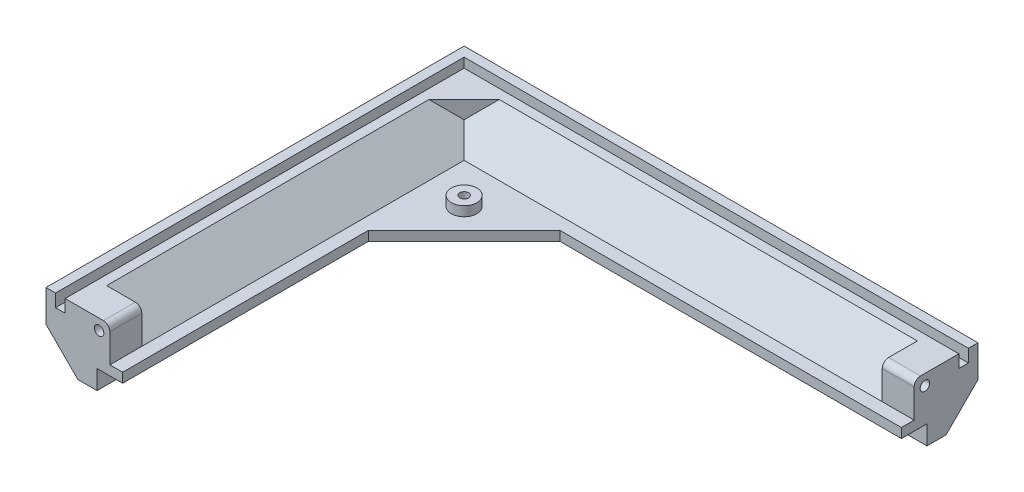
ISO-10303-21;
HEADER;
FILE_DESCRIPTION(('STEP AP214'),'2;1');
FILE_NAME('part.step','',(''),(''),'','','');
FILE_SCHEMA(('AUTOMOTIVE_DESIGN { 1 0 10303 214 1 1 1 1 }'));
ENDSEC;
DATA;
#1=APPLICATION_CONTEXT('core data for automotive mechanical design processes');
#2=APPLICATION_PROTOCOL_DEFINITION('international standard','automotive_design',2000,#1);
#3=PRODUCT_CONTEXT('',#1,'mechanical');
#4=PRODUCT('Part','Part','',(#3));
#5=PRODUCT_RELATED_PRODUCT_CATEGORY('part','',(#4));
#6=PRODUCT_DEFINITION_FORMATION('','',#4);
#7=PRODUCT_DEFINITION_CONTEXT('part definition',#1,'design');
#8=PRODUCT_DEFINITION('design','',#6,#7);
#9=PRODUCT_DEFINITION_SHAPE('','',#8);
#10=(LENGTH_UNIT() NAMED_UNIT(*) SI_UNIT(.MILLI.,.METRE.));
#11=(NAMED_UNIT(*) PLANE_ANGLE_UNIT() SI_UNIT($,.RADIAN.));
#12=(NAMED_UNIT(*) SI_UNIT($,.STERADIAN.) SOLID_ANGLE_UNIT());
#13=UNCERTAINTY_MEASURE_WITH_UNIT(LENGTH_MEASURE(1.E-05),#10,'distance_accuracy_value','');
#14=(GEOMETRIC_REPRESENTATION_CONTEXT(3) GLOBAL_UNCERTAINTY_ASSIGNED_CONTEXT((#13)) GLOBAL_UNIT_ASSIGNED_CONTEXT((#10,
#11,#12)) REPRESENTATION_CONTEXT('',''));
#15=CARTESIAN_POINT('',(0.,0.,0.));
#16=DIRECTION('',(0.,0.,1.));
#17=DIRECTION('',(1.,0.,0.));
#18=AXIS2_PLACEMENT_3D('',#15,#16,#17);
#19=CARTESIAN_POINT('',(-40.0578695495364,-11.,10.5477331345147));
#20=DIRECTION('',(0.,-1.,0.));
#21=DIRECTION('',(0.,0.,-1.));
#22=AXIS2_PLACEMENT_3D('',#19,#20,#21);
#23=PLANE('',#22);
#24=DIRECTION('',(-1.,0.,0.));
#25=VECTOR('',#24,1.);
#26=CARTESIAN_POINT('',(100.942130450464,-11.,6.54773313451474));
#27=LINE('',#26,#25);
#28=CARTESIAN_POINT('',(100.942130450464,-11.,6.54773313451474));
#29=VERTEX_POINT('',#28);
#30=CARTESIAN_POINT('',(90.9421304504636,-11.,6.54773313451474));
#31=VERTEX_POINT('',#30);
#32=EDGE_CURVE('E347',#29,#31,#27,.T.);
#33=ORIENTED_EDGE('',*,*,#32,.T.);
#34=CARTESIAN_POINT('',(-40.0578695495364,-11.,6.54773313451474));
#35=VERTEX_POINT('',#34);
#36=EDGE_CURVE('E228',#31,#35,#27,.T.);
#37=ORIENTED_EDGE('',*,*,#36,.T.);
#38=DIRECTION('',(0.,0.,-1.));
#39=VECTOR('',#38,1.);
#40=CARTESIAN_POINT('',(-40.0578695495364,-11.,117.547733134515));
#41=LINE('',#40,#39);
#42=CARTESIAN_POINT('',(-40.0578695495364,-11.,107.547733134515));
#43=VERTEX_POINT('',#42);
#44=EDGE_CURVE('E219',#43,#35,#41,.T.);
#45=ORIENTED_EDGE('',*,*,#44,.F.);
#46=CARTESIAN_POINT('',(-40.0578695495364,-11.,117.547733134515));
#47=VERTEX_POINT('',#46);
#48=EDGE_CURVE('E225',#47,#43,#41,.T.);
#49=ORIENTED_EDGE('',*,*,#48,.F.);
#50=DIRECTION('',(-1.,0.,0.));
#51=VECTOR('',#50,1.);
#52=CARTESIAN_POINT('',(-36.0578695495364,-11.,117.547733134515));
#53=LINE('',#52,#51);
#54=CARTESIAN_POINT('',(-36.0578695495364,-11.,117.547733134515));
#55=VERTEX_POINT('',#54);
#56=EDGE_CURVE('E279',#55,#47,#53,.T.);
#57=ORIENTED_EDGE('',*,*,#56,.F.);
#58=DIRECTION('',(0.,0.,1.));
#59=VECTOR('',#58,1.);
#60=CARTESIAN_POINT('',(-36.0578695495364,-11.,117.547733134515));
#61=LINE('',#60,#59);
#62=CARTESIAN_POINT('',(-36.0578695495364,-11.,40.5477331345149));
#63=VERTEX_POINT('',#62);
#64=EDGE_CURVE('E271',#63,#55,#61,.T.);
#65=ORIENTED_EDGE('',*,*,#64,.F.);
#66=DIRECTION('',(-0.707106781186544,0.,0.707106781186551));
#67=VECTOR('',#66,1.);
#68=CARTESIAN_POINT('',(-23.0578695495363,-11.,27.5477331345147));
#69=LINE('',#68,#67);
#70=CARTESIAN_POINT('',(-6.05786954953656,-11.,10.5477331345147));
#71=VERTEX_POINT('',#70);
#72=EDGE_CURVE('E410',#63,#71,#69,.F.);
#73=ORIENTED_EDGE('',*,*,#72,.T.);
#74=DIRECTION('',(-1.,0.,0.));
#75=VECTOR('',#74,1.);
#76=CARTESIAN_POINT('',(-40.0578695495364,-11.,10.5477331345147));
#77=LINE('',#76,#75);
#78=CARTESIAN_POINT('',(100.942130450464,-11.,10.5477331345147));
#79=VERTEX_POINT('',#78);
#80=EDGE_CURVE('E285',#79,#71,#77,.T.);
#81=ORIENTED_EDGE('',*,*,#80,.F.);
#82=DIRECTION('',(0.,0.,-1.));
#83=VECTOR('',#82,1.);
#84=CARTESIAN_POINT('',(100.942130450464,-11.,10.5477331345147));
#85=LINE('',#84,#83);
#86=EDGE_CURVE('E288',#79,#29,#85,.T.);
#87=ORIENTED_EDGE('',*,*,#86,.T.);
#88=EDGE_LOOP('',(#33,#37,#45,#49,#57,#65,#73,#81,#87));
#89=FACE_BOUND('',#88,.T.);
#90=CARTESIAN_POINT('',(-27.5578695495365,-11.,19.0477331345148));
#91=DIRECTION('',(0.,-1.,0.));
#92=DIRECTION('',(0.,0.,-1.));
#93=AXIS2_PLACEMENT_3D('',#90,#91,#92);
#94=CIRCLE('',#93,4.);
#95=CARTESIAN_POINT('',(-27.5578695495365,-11.,15.0477331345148));
#96=VERTEX_POINT('',#95);
#97=EDGE_CURVE('E11',#96,#96,#94,.F.);
#98=ORIENTED_EDGE('',*,*,#97,.F.);
#99=EDGE_LOOP('',(#98));
#100=FACE_BOUND('',#99,.T.);
#101=ADVANCED_FACE('F35',(#89,#100),#23,.F.);
#102=CARTESIAN_POINT('',(0.,0.,10.5477331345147));
#103=DIRECTION('',(0.,0.,-1.));
#104=DIRECTION('',(-1.,0.,0.));
#105=AXIS2_PLACEMENT_3D('',#102,#103,#104);
#106=PLANE('',#105);
#107=ORIENTED_EDGE('',*,*,#80,.T.);
#108=DIRECTION('',(0.,-1.,0.));
#109=VECTOR('',#108,1.);
#110=CARTESIAN_POINT('',(-6.05786954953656,-14.,10.5477331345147));
#111=LINE('',#110,#109);
#112=CARTESIAN_POINT('',(-6.05786954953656,-14.,10.5477331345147));
#113=VERTEX_POINT('',#112);
#114=EDGE_CURVE('E408',#71,#113,#111,.T.);
#115=ORIENTED_EDGE('',*,*,#114,.T.);
#116=DIRECTION('',(1.,0.,0.));
#117=VECTOR('',#116,1.);
#118=CARTESIAN_POINT('',(100.942130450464,-14.,10.5477331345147));
#119=LINE('',#118,#117);
#120=CARTESIAN_POINT('',(100.942130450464,-14.,10.5477331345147));
#121=VERTEX_POINT('',#120);
#122=EDGE_CURVE('E281',#113,#121,#119,.T.);
#123=ORIENTED_EDGE('',*,*,#122,.T.);
#124=DIRECTION('',(0.,1.,0.));
#125=VECTOR('',#124,1.);
#126=CARTESIAN_POINT('',(100.942130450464,-11.,10.5477331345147));
#127=LINE('',#126,#125);
#128=EDGE_CURVE('E283',#121,#79,#127,.T.);
#129=ORIENTED_EDGE('',*,*,#128,.T.);
#130=EDGE_LOOP('',(#107,#115,#123,#129));
#131=FACE_BOUND('',#130,.T.);
#132=ADVANCED_FACE('F460',(#131),#106,.F.);
#133=CARTESIAN_POINT('',(-51.0578695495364,-11.,6.54773313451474));
#134=DIRECTION('',(-0.707106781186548,0.,-0.707106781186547));
#135=DIRECTION('',(-0.707106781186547,0.,0.707106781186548));
#136=AXIS2_PLACEMENT_3D('',#133,#134,#135);
#137=PLANE('',#136);
#138=DIRECTION('',(-0.577350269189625,0.577350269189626,0.577350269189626));
#139=VECTOR('',#138,1.);
#140=CARTESIAN_POINT('',(-47.3912028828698,-3.66666666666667,2.88106646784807));
#141=LINE('',#140,#139);
#142=CARTESIAN_POINT('',(-45.5578695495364,-5.49999999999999,1.04773313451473));
#143=VERTEX_POINT('',#142);
#144=CARTESIAN_POINT('',(-51.0578695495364,0.,6.54773313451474));
#145=VERTEX_POINT('',#144);
#146=EDGE_CURVE('E298',#143,#145,#141,.T.);
#147=ORIENTED_EDGE('',*,*,#146,.F.);
#148=DIRECTION('',(-0.577350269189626,-0.577350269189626,0.577350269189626));
#149=VECTOR('',#148,1.);
#150=CARTESIAN_POINT('',(-51.0578695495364,-11.,6.54773313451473));
#151=LINE('',#150,#149);
#152=CARTESIAN_POINT('',(-40.0578695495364,0.,-4.45226686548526));
#153=VERTEX_POINT('',#152);
#154=EDGE_CURVE('E300',#153,#143,#151,.T.);
#155=ORIENTED_EDGE('',*,*,#154,.F.);
#156=DIRECTION('',(-0.707106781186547,0.,0.707106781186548));
#157=VECTOR('',#156,1.);
#158=CARTESIAN_POINT('',(-51.0578695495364,0.,6.54773313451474));
#159=LINE('',#158,#157);
#160=EDGE_CURVE('E303',#153,#145,#159,.T.);
#161=ORIENTED_EDGE('',*,*,#160,.T.);
#162=EDGE_LOOP('',(#147,#155,#161));
#163=FACE_BOUND('',#162,.T.);
#164=ADVANCED_FACE('F465',(#163),#137,.F.);
#165=CARTESIAN_POINT('',(100.942130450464,0.,-4.45226686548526));
#166=DIRECTION('',(0.,-0.707106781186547,-0.707106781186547));
#167=DIRECTION('',(0.,0.707106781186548,-0.707106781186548));
#168=AXIS2_PLACEMENT_3D('',#165,#166,#167);
#169=PLANE('',#168);
#170=ORIENTED_EDGE('',*,*,#36,.F.);
#171=DIRECTION('',(0.,0.707106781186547,-0.707106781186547));
#172=VECTOR('',#171,1.);
#173=CARTESIAN_POINT('',(90.9421304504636,0.,-4.45226686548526));
#174=LINE('',#173,#172);
#175=CARTESIAN_POINT('',(90.9421304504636,0.,-4.45226686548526));
#176=VERTEX_POINT('',#175);
#177=EDGE_CURVE('E261',#31,#176,#174,.T.);
#178=ORIENTED_EDGE('',*,*,#177,.T.);
#179=DIRECTION('',(-1.,0.,0.));
#180=VECTOR('',#179,1.);
#181=CARTESIAN_POINT('',(100.942130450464,0.,-4.45226686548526));
#182=LINE('',#181,#180);
#183=EDGE_CURVE('E349',#176,#153,#182,.T.);
#184=ORIENTED_EDGE('',*,*,#183,.T.);
#185=ORIENTED_EDGE('',*,*,#154,.T.);
#186=DIRECTION('',(-0.577350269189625,0.577350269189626,-0.577350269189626));
#187=VECTOR('',#186,1.);
#188=CARTESIAN_POINT('',(-0.391202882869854,-50.6666666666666,46.2143998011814));
#189=LINE('',#188,#187);
#190=EDGE_CURVE('E296',#35,#143,#189,.T.);
#191=ORIENTED_EDGE('',*,*,#190,.F.);
#192=EDGE_LOOP('',(#170,#178,#184,#185,#191));
#193=FACE_BOUND('',#192,.T.);
#194=ADVANCED_FACE('F472',(#193),#169,.F.);
#195=CARTESIAN_POINT('',(-54.0578695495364,0.,117.547733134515));
#196=DIRECTION('',(0.,-1.,0.));
#197=DIRECTION('',(0.,0.,-1.));
#198=AXIS2_PLACEMENT_3D('',#195,#196,#197);
#199=PLANE('',#198);
#200=DIRECTION('',(0.,0.,-1.));
#201=VECTOR('',#200,1.);
#202=CARTESIAN_POINT('',(-57.0578695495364,0.,117.547733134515));
#203=LINE('',#202,#201);
#204=CARTESIAN_POINT('',(-57.0578695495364,0.,117.547733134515));
#205=VERTEX_POINT('',#204);
#206=CARTESIAN_POINT('',(-57.0578695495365,0.,-10.4522668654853));
#207=VERTEX_POINT('',#206);
#208=EDGE_CURVE('E387',#205,#207,#203,.T.);
#209=ORIENTED_EDGE('',*,*,#208,.T.);
#210=DIRECTION('',(-1.,0.,0.));
#211=VECTOR('',#210,1.);
#212=CARTESIAN_POINT('',(100.942130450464,0.,-10.4522668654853));
#213=LINE('',#212,#211);
#214=CARTESIAN_POINT('',(100.942130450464,0.,-10.4522668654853));
#215=VERTEX_POINT('',#214);
#216=EDGE_CURVE('E335',#215,#207,#213,.T.);
#217=ORIENTED_EDGE('',*,*,#216,.F.);
#218=DIRECTION('',(0.,0.,1.));
#219=VECTOR('',#218,1.);
#220=CARTESIAN_POINT('',(100.942130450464,0.,-13.4522668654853));
#221=LINE('',#220,#219);
#222=CARTESIAN_POINT('',(100.942130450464,0.,-13.4522668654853));
#223=VERTEX_POINT('',#222);
#224=EDGE_CURVE('E333',#223,#215,#221,.T.);
#225=ORIENTED_EDGE('',*,*,#224,.F.);
#226=DIRECTION('',(-1.,0.,0.));
#227=VECTOR('',#226,1.);
#228=CARTESIAN_POINT('',(-40.0578695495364,0.,-13.4522668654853));
#229=LINE('',#228,#227);
#230=CARTESIAN_POINT('',(-60.0578695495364,0.,-13.4522668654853));
#231=VERTEX_POINT('',#230);
#232=EDGE_CURVE('E360',#223,#231,#229,.T.);
#233=ORIENTED_EDGE('',*,*,#232,.T.);
#234=DIRECTION('',(0.,0.,-1.));
#235=VECTOR('',#234,1.);
#236=CARTESIAN_POINT('',(-60.0578695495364,0.,117.547733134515));
#237=LINE('',#236,#235);
#238=CARTESIAN_POINT('',(-60.0578695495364,0.,117.547733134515));
#239=VERTEX_POINT('',#238);
#240=EDGE_CURVE('E402',#239,#231,#237,.T.);
#241=ORIENTED_EDGE('',*,*,#240,.F.);
#242=DIRECTION('',(-1.,0.,0.));
#243=VECTOR('',#242,1.);
#244=CARTESIAN_POINT('',(-60.0578695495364,0.,117.547733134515));
#245=LINE('',#244,#243);
#246=EDGE_CURVE('E365',#205,#239,#245,.T.);
#247=ORIENTED_EDGE('',*,*,#246,.F.);
#248=EDGE_LOOP('',(#209,#217,#225,#233,#241,#247));
#249=FACE_BOUND('',#248,.T.);
#250=ADVANCED_FACE('F490',(#249),#199,.F.);
#251=CARTESIAN_POINT('',(-60.0578695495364,-10.,117.547733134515));
#252=DIRECTION('',(1.,0.,0.));
#253=DIRECTION('',(0.,0.,-1.));
#254=AXIS2_PLACEMENT_3D('',#251,#252,#253);
#255=PLANE('',#254);
#256=DIRECTION('',(0.,1.,0.));
#257=VECTOR('',#256,1.);
#258=CARTESIAN_POINT('',(-60.0578695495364,-20.,-13.4522668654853));
#259=LINE('',#258,#257);
#260=CARTESIAN_POINT('',(-60.0578695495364,-10.,-13.4522668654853));
#261=VERTEX_POINT('',#260);
#262=EDGE_CURVE('E363',#261,#231,#259,.T.);
#263=ORIENTED_EDGE('',*,*,#262,.F.);
#264=DIRECTION('',(0.,0.,-1.));
#265=VECTOR('',#264,1.);
#266=CARTESIAN_POINT('',(-60.0578695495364,-10.,117.547733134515));
#267=LINE('',#266,#265);
#268=CARTESIAN_POINT('',(-60.0578695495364,-10.,117.547733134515));
#269=VERTEX_POINT('',#268);
#270=EDGE_CURVE('E400',#269,#261,#267,.T.);
#271=ORIENTED_EDGE('',*,*,#270,.F.);
#272=DIRECTION('',(0.,-1.,0.));
#273=VECTOR('',#272,1.);
#274=CARTESIAN_POINT('',(-60.0578695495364,-10.,117.547733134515));
#275=LINE('',#274,#273);
#276=EDGE_CURVE('E368',#239,#269,#275,.T.);
#277=ORIENTED_EDGE('',*,*,#276,.F.);
#278=ORIENTED_EDGE('',*,*,#240,.T.);
#279=EDGE_LOOP('',(#263,#271,#277,#278));
#280=FACE_BOUND('',#279,.T.);
#281=ADVANCED_FACE('F536',(#280),#255,.F.);
#282=CARTESIAN_POINT('',(-50.0578695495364,-20.,117.547733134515));
#283=DIRECTION('',(0.707106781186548,0.707106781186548,0.));
#284=DIRECTION('',(-0.707106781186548,0.707106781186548,0.));
#285=AXIS2_PLACEMENT_3D('',#282,#283,#284);
#286=PLANE('',#285);
#287=ORIENTED_EDGE('',*,*,#270,.T.);
#288=DIRECTION('',(-0.577350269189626,0.577350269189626,-0.577350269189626));
#289=VECTOR('',#288,1.);
#290=CARTESIAN_POINT('',(-6.39120288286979,-63.6666666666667,40.2143998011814));
#291=LINE('',#290,#289);
#292=CARTESIAN_POINT('',(-50.0578695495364,-20.,-3.45226686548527));
#293=VERTEX_POINT('',#292);
#294=EDGE_CURVE('E414',#293,#261,#291,.T.);
#295=ORIENTED_EDGE('',*,*,#294,.F.);
#296=DIRECTION('',(0.,0.,-1.));
#297=VECTOR('',#296,1.);
#298=CARTESIAN_POINT('',(-50.0578695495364,-20.,117.547733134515));
#299=LINE('',#298,#297);
#300=CARTESIAN_POINT('',(-50.0578695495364,-20.,117.547733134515));
#301=VERTEX_POINT('',#300);
#302=EDGE_CURVE('E398',#301,#293,#299,.T.);
#303=ORIENTED_EDGE('',*,*,#302,.F.);
#304=DIRECTION('',(0.707106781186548,-0.707106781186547,0.));
#305=VECTOR('',#304,1.);
#306=CARTESIAN_POINT('',(-50.0578695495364,-20.,117.547733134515));
#307=LINE('',#306,#305);
#308=EDGE_CURVE('E370',#269,#301,#307,.T.);
#309=ORIENTED_EDGE('',*,*,#308,.F.);
#310=EDGE_LOOP('',(#287,#295,#303,#309));
#311=FACE_BOUND('',#310,.T.);
#312=ADVANCED_FACE('F532',(#311),#286,.F.);
#313=CARTESIAN_POINT('',(-50.0578695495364,-20.,117.547733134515));
#314=DIRECTION('',(0.,1.,0.));
#315=DIRECTION('',(0.,0.,1.));
#316=AXIS2_PLACEMENT_3D('',#313,#314,#315);
#317=PLANE('',#316);
#318=ORIENTED_EDGE('',*,*,#302,.T.);
#319=DIRECTION('',(-1.,0.,0.));
#320=VECTOR('',#319,1.);
#321=CARTESIAN_POINT('',(100.942130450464,-20.,-3.45226686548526));
#322=LINE('',#321,#320);
#323=CARTESIAN_POINT('',(100.942130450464,-20.,-3.45226686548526));
#324=VERTEX_POINT('',#323);
#325=EDGE_CURVE('E341',#324,#293,#322,.T.);
#326=ORIENTED_EDGE('',*,*,#325,.F.);
#327=DIRECTION('',(0.,0.,-1.));
#328=VECTOR('',#327,1.);
#329=CARTESIAN_POINT('',(100.942130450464,-20.,6.54773313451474));
#330=LINE('',#329,#328);
#331=CARTESIAN_POINT('',(100.942130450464,-20.,2.54773313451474));
#332=VERTEX_POINT('',#331);
#333=EDGE_CURVE('E326',#332,#324,#330,.T.);
#334=ORIENTED_EDGE('',*,*,#333,.F.);
#335=DIRECTION('',(-1.,0.,0.));
#336=VECTOR('',#335,1.);
#337=CARTESIAN_POINT('',(100.942130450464,-20.,2.54773313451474));
#338=LINE('',#337,#336);
#339=CARTESIAN_POINT('',(-24.0578695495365,-20.,2.54773313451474));
#340=VERTEX_POINT('',#339);
#341=EDGE_CURVE('E291',#332,#340,#338,.T.);
#342=ORIENTED_EDGE('',*,*,#341,.T.);
#343=DIRECTION('',(0.707106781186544,0.,-0.707106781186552));
#344=VECTOR('',#343,1.);
#345=CARTESIAN_POINT('',(-94.5578695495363,-20.,73.0477331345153));
#346=LINE('',#345,#344);
#347=CARTESIAN_POINT('',(-44.0578695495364,-20.,22.5477331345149));
#348=VERTEX_POINT('',#347);
#349=EDGE_CURVE('E424',#340,#348,#346,.F.);
#350=ORIENTED_EDGE('',*,*,#349,.T.);
#351=DIRECTION('',(0.,0.,1.));
#352=VECTOR('',#351,1.);
#353=CARTESIAN_POINT('',(-44.0578695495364,-20.,2.54773313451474));
#354=LINE('',#353,#352);
#355=CARTESIAN_POINT('',(-44.0578695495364,-20.,117.547733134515));
#356=VERTEX_POINT('',#355);
#357=EDGE_CURVE('E294',#348,#356,#354,.T.);
#358=ORIENTED_EDGE('',*,*,#357,.T.);
#359=DIRECTION('',(1.,0.,0.));
#360=VECTOR('',#359,1.);
#361=CARTESIAN_POINT('',(-50.0578695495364,-20.,117.547733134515));
#362=LINE('',#361,#360);
#363=EDGE_CURVE('E372',#301,#356,#362,.T.);
#364=ORIENTED_EDGE('',*,*,#363,.F.);
#365=EDGE_LOOP('',(#318,#326,#334,#342,#350,#358,#364));
#366=FACE_BOUND('',#365,.T.);
#367=ADVANCED_FACE('F528',(#366),#317,.F.);
#368=CARTESIAN_POINT('',(-44.0578695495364,-17.,117.547733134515));
#369=DIRECTION('',(-1.,0.,0.));
#370=DIRECTION('',(0.,0.,1.));
#371=AXIS2_PLACEMENT_3D('',#368,#369,#370);
#372=PLANE('',#371);
#373=ORIENTED_EDGE('',*,*,#357,.F.);
#374=DIRECTION('',(0.,1.,0.));
#375=VECTOR('',#374,1.);
#376=CARTESIAN_POINT('',(-44.0578695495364,-14.,22.5477331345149));
#377=LINE('',#376,#375);
#378=CARTESIAN_POINT('',(-44.0578695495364,-14.,22.5477331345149));
#379=VERTEX_POINT('',#378);
#380=EDGE_CURVE('E417',#348,#379,#377,.T.);
#381=ORIENTED_EDGE('',*,*,#380,.T.);
#382=DIRECTION('',(0.,0.,-1.));
#383=VECTOR('',#382,1.);
#384=CARTESIAN_POINT('',(-44.0578695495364,-14.,117.547733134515));
#385=LINE('',#384,#383);
#386=CARTESIAN_POINT('',(-44.0578695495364,-14.,117.547733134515));
#387=VERTEX_POINT('',#386);
#388=EDGE_CURVE('E245',#387,#379,#385,.T.);
#389=ORIENTED_EDGE('',*,*,#388,.F.);
#390=DIRECTION('',(0.,1.,0.));
#391=VECTOR('',#390,1.);
#392=CARTESIAN_POINT('',(-44.0578695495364,-17.,117.547733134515));
#393=LINE('',#392,#391);
#394=EDGE_CURVE('E375',#356,#387,#393,.T.);
#395=ORIENTED_EDGE('',*,*,#394,.F.);
#396=EDGE_LOOP('',(#373,#381,#389,#395));
#397=FACE_BOUND('',#396,.T.);
#398=ADVANCED_FACE('F524',(#397),#372,.F.);
#399=CARTESIAN_POINT('',(-44.0578695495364,-14.,117.547733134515));
#400=DIRECTION('',(0.,1.,0.));
#401=DIRECTION('',(0.,0.,1.));
#402=AXIS2_PLACEMENT_3D('',#399,#400,#401);
#403=PLANE('',#402);
#404=CARTESIAN_POINT('',(-27.5578695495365,-14.,19.0477331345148));
#405=DIRECTION('',(0.,-1.,0.));
#406=DIRECTION('',(0.,0.,-1.));
#407=AXIS2_PLACEMENT_3D('',#404,#405,#406);
#408=CIRCLE('',#407,1.4);
#409=CARTESIAN_POINT('',(-27.5578695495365,-14.,17.6477331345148));
#410=VERTEX_POINT('',#409);
#411=EDGE_CURVE('E267',#410,#410,#408,.T.);
#412=ORIENTED_EDGE('',*,*,#411,.F.);
#413=EDGE_LOOP('',(#412));
#414=FACE_BOUND('',#413,.T.);
#415=ORIENTED_EDGE('',*,*,#388,.T.);
#416=DIRECTION('',(-0.707106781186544,0.,0.707106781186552));
#417=VECTOR('',#416,1.);
#418=CARTESIAN_POINT('',(-44.0578695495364,-14.,22.5477331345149));
#419=LINE('',#418,#417);
#420=CARTESIAN_POINT('',(-24.0578695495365,-14.,2.54773313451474));
#421=VERTEX_POINT('',#420);
#422=EDGE_CURVE('E420',#379,#421,#419,.F.);
#423=ORIENTED_EDGE('',*,*,#422,.T.);
#424=DIRECTION('',(-1.,0.,0.));
#425=VECTOR('',#424,1.);
#426=CARTESIAN_POINT('',(100.942130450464,-14.,2.54773313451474));
#427=LINE('',#426,#425);
#428=CARTESIAN_POINT('',(100.942130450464,-14.,2.54773313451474));
#429=VERTEX_POINT('',#428);
#430=EDGE_CURVE('E344',#429,#421,#427,.T.);
#431=ORIENTED_EDGE('',*,*,#430,.F.);
#432=DIRECTION('',(0.,0.,-1.));
#433=VECTOR('',#432,1.);
#434=CARTESIAN_POINT('',(100.942130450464,-14.,6.54773313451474));
#435=LINE('',#434,#433);
#436=EDGE_CURVE('E322',#121,#429,#435,.T.);
#437=ORIENTED_EDGE('',*,*,#436,.F.);
#438=ORIENTED_EDGE('',*,*,#122,.F.);
#439=DIRECTION('',(0.707106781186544,0.,-0.707106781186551));
#440=VECTOR('',#439,1.);
#441=CARTESIAN_POINT('',(-78.5578695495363,-14.,83.0477331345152));
#442=LINE('',#441,#440);
#443=CARTESIAN_POINT('',(-36.0578695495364,-14.,40.5477331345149));
#444=VERTEX_POINT('',#443);
#445=EDGE_CURVE('E412',#113,#444,#442,.F.);
#446=ORIENTED_EDGE('',*,*,#445,.T.);
#447=DIRECTION('',(0.,0.,-1.));
#448=VECTOR('',#447,1.);
#449=CARTESIAN_POINT('',(-36.0578695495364,-14.,10.5477331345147));
#450=LINE('',#449,#448);
#451=CARTESIAN_POINT('',(-36.0578695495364,-14.,117.547733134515));
#452=VERTEX_POINT('',#451);
#453=EDGE_CURVE('E276',#452,#444,#450,.T.);
#454=ORIENTED_EDGE('',*,*,#453,.F.);
#455=DIRECTION('',(1.,0.,0.));
#456=VECTOR('',#455,1.);
#457=CARTESIAN_POINT('',(-44.0578695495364,-14.,117.547733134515));
#458=LINE('',#457,#456);
#459=EDGE_CURVE('E377',#387,#452,#458,.T.);
#460=ORIENTED_EDGE('',*,*,#459,.F.);
#461=EDGE_LOOP('',(#415,#423,#431,#437,#438,#446,#454,#460));
#462=FACE_BOUND('',#461,.T.);
#463=ADVANCED_FACE('F521',(#414,#462),#403,.F.);
#464=CARTESIAN_POINT('',(-40.0578695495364,-11.,117.547733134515));
#465=DIRECTION('',(-0.707106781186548,-0.707106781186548,0.));
#466=DIRECTION('',(0.707106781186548,-0.707106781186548,0.));
#467=AXIS2_PLACEMENT_3D('',#464,#465,#466);
#468=PLANE('',#467);
#469=DIRECTION('',(0.,0.,-1.));
#470=VECTOR('',#469,1.);
#471=CARTESIAN_POINT('',(-51.0578695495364,0.,117.547733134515));
#472=LINE('',#471,#470);
#473=CARTESIAN_POINT('',(-51.0578695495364,0.,107.547733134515));
#474=VERTEX_POINT('',#473);
#475=EDGE_CURVE('E231',#474,#145,#472,.T.);
#476=ORIENTED_EDGE('',*,*,#475,.F.);
#477=DIRECTION('',(0.707106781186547,-0.707106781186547,0.));
#478=VECTOR('',#477,1.);
#479=CARTESIAN_POINT('',(-51.0578695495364,0.,107.547733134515));
#480=LINE('',#479,#478);
#481=EDGE_CURVE('E235',#474,#43,#480,.T.);
#482=ORIENTED_EDGE('',*,*,#481,.T.);
#483=ORIENTED_EDGE('',*,*,#44,.T.);
#484=ORIENTED_EDGE('',*,*,#190,.T.);
#485=ORIENTED_EDGE('',*,*,#146,.T.);
#486=EDGE_LOOP('',(#476,#482,#483,#484,#485));
#487=FACE_BOUND('',#486,.T.);
#488=ADVANCED_FACE('F236',(#487),#468,.F.);
#489=DIRECTION('',(0.,0.,1.));
#490=VECTOR('',#489,1.);
#491=CARTESIAN_POINT('',(90.9421304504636,0.,6.54773313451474));
#492=LINE('',#491,#490);
#493=CARTESIAN_POINT('',(90.9421304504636,0.,4.54773313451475));
#494=VERTEX_POINT('',#493);
#495=EDGE_CURVE('E264',#176,#494,#492,.T.);
#496=ORIENTED_EDGE('',*,*,#495,.T.);
#497=DIRECTION('',(1.,0.,0.));
#498=VECTOR('',#497,1.);
#499=CARTESIAN_POINT('',(100.942130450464,0.,4.54773313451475));
#500=LINE('',#499,#498);
#501=CARTESIAN_POINT('',(100.942130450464,0.,4.54773313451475));
#502=VERTEX_POINT('',#501);
#503=EDGE_CURVE('E428',#494,#502,#500,.T.);
#504=ORIENTED_EDGE('',*,*,#503,.T.);
#505=DIRECTION('',(0.,0.,1.));
#506=VECTOR('',#505,1.);
#507=CARTESIAN_POINT('',(100.942130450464,0.,-7.45226686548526));
#508=LINE('',#507,#506);
#509=CARTESIAN_POINT('',(100.942130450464,0.,-7.45226686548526));
#510=VERTEX_POINT('',#509);
#511=EDGE_CURVE('E319',#510,#502,#508,.T.);
#512=ORIENTED_EDGE('',*,*,#511,.F.);
#513=DIRECTION('',(-1.,0.,0.));
#514=VECTOR('',#513,1.);
#515=CARTESIAN_POINT('',(100.942130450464,0.,-7.45226686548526));
#516=LINE('',#515,#514);
#517=CARTESIAN_POINT('',(-54.0578695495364,0.,-7.45226686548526));
#518=VERTEX_POINT('',#517);
#519=EDGE_CURVE('E351',#510,#518,#516,.T.);
#520=ORIENTED_EDGE('',*,*,#519,.T.);
#521=DIRECTION('',(0.,0.,-1.));
#522=VECTOR('',#521,1.);
#523=CARTESIAN_POINT('',(-54.0578695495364,0.,117.547733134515));
#524=LINE('',#523,#522);
#525=CARTESIAN_POINT('',(-54.0578695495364,0.,117.547733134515));
#526=VERTEX_POINT('',#525);
#527=EDGE_CURVE('E393',#526,#518,#524,.T.);
#528=ORIENTED_EDGE('',*,*,#527,.F.);
#529=DIRECTION('',(-1.,0.,0.));
#530=VECTOR('',#529,1.);
#531=CARTESIAN_POINT('',(-54.0578695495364,0.,117.547733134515));
#532=LINE('',#531,#530);
#533=CARTESIAN_POINT('',(-42.0578695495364,0.,117.547733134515));
#534=VERTEX_POINT('',#533);
#535=EDGE_CURVE('E379',#534,#526,#532,.T.);
#536=ORIENTED_EDGE('',*,*,#535,.F.);
#537=DIRECTION('',(0.,0.,1.));
#538=VECTOR('',#537,1.);
#539=CARTESIAN_POINT('',(-42.0578695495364,0.,107.547733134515));
#540=LINE('',#539,#538);
#541=CARTESIAN_POINT('',(-42.0578695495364,0.,107.547733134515));
#542=VERTEX_POINT('',#541);
#543=EDGE_CURVE('E426',#534,#542,#540,.F.);
#544=ORIENTED_EDGE('',*,*,#543,.T.);
#545=DIRECTION('',(-1.,0.,0.));
#546=VECTOR('',#545,1.);
#547=CARTESIAN_POINT('',(-40.0578695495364,0.,107.547733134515));
#548=LINE('',#547,#546);
#549=EDGE_CURVE('E239',#542,#474,#548,.T.);
#550=ORIENTED_EDGE('',*,*,#549,.T.);
#551=ORIENTED_EDGE('',*,*,#475,.T.);
#552=ORIENTED_EDGE('',*,*,#160,.F.);
#553=ORIENTED_EDGE('',*,*,#183,.F.);
#554=EDGE_LOOP('',(#496,#504,#512,#520,#528,#536,#544,#550,#551,#552,#553));
#555=FACE_BOUND('',#554,.T.);
#556=ADVANCED_FACE('F445',(#555),#199,.F.);
#557=CARTESIAN_POINT('',(-54.0578695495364,-4.,117.547733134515));
#558=DIRECTION('',(1.,0.,0.));
#559=DIRECTION('',(0.,0.,-1.));
#560=AXIS2_PLACEMENT_3D('',#557,#558,#559);
#561=PLANE('',#560);
#562=ORIENTED_EDGE('',*,*,#527,.T.);
#563=DIRECTION('',(0.,1.,0.));
#564=VECTOR('',#563,1.);
#565=CARTESIAN_POINT('',(-54.0578695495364,0.,-7.45226686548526));
#566=LINE('',#565,#564);
#567=CARTESIAN_POINT('',(-54.0578695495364,-4.,-7.45226686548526));
#568=VERTEX_POINT('',#567);
#569=EDGE_CURVE('E306',#568,#518,#566,.T.);
#570=ORIENTED_EDGE('',*,*,#569,.F.);
#571=DIRECTION('',(0.,0.,-1.));
#572=VECTOR('',#571,1.);
#573=CARTESIAN_POINT('',(-54.0578695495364,-4.,117.547733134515));
#574=LINE('',#573,#572);
#575=CARTESIAN_POINT('',(-54.0578695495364,-4.,117.547733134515));
#576=VERTEX_POINT('',#575);
#577=EDGE_CURVE('E391',#576,#568,#574,.T.);
#578=ORIENTED_EDGE('',*,*,#577,.F.);
#579=DIRECTION('',(0.,-1.,0.));
#580=VECTOR('',#579,1.);
#581=CARTESIAN_POINT('',(-54.0578695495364,-4.,117.547733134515));
#582=LINE('',#581,#580);
#583=EDGE_CURVE('E381',#526,#576,#582,.T.);
#584=ORIENTED_EDGE('',*,*,#583,.F.);
#585=EDGE_LOOP('',(#562,#570,#578,#584));
#586=FACE_BOUND('',#585,.T.);
#587=ADVANCED_FACE('F512',(#586),#561,.F.);
#588=CARTESIAN_POINT('',(-57.0578695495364,-4.,117.547733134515));
#589=DIRECTION('',(0.,-1.,0.));
#590=DIRECTION('',(0.,0.,-1.));
#591=AXIS2_PLACEMENT_3D('',#588,#589,#590);
#592=PLANE('',#591);
#593=ORIENTED_EDGE('',*,*,#577,.T.);
#594=DIRECTION('',(-1.,0.,0.));
#595=VECTOR('',#594,1.);
#596=CARTESIAN_POINT('',(100.942130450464,-4.,-7.45226686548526));
#597=LINE('',#596,#595);
#598=CARTESIAN_POINT('',(100.942130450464,-4.,-7.45226686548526));
#599=VERTEX_POINT('',#598);
#600=EDGE_CURVE('E354',#599,#568,#597,.T.);
#601=ORIENTED_EDGE('',*,*,#600,.F.);
#602=DIRECTION('',(0.,0.,1.));
#603=VECTOR('',#602,1.);
#604=CARTESIAN_POINT('',(100.942130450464,-4.,-7.45226686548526));
#605=LINE('',#604,#603);
#606=CARTESIAN_POINT('',(100.942130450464,-4.,-10.4522668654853));
#607=VERTEX_POINT('',#606);
#608=EDGE_CURVE('E315',#607,#599,#605,.T.);
#609=ORIENTED_EDGE('',*,*,#608,.F.);
#610=DIRECTION('',(-1.,0.,0.));
#611=VECTOR('',#610,1.);
#612=CARTESIAN_POINT('',(100.942130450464,-4.,-10.4522668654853));
#613=LINE('',#612,#611);
#614=CARTESIAN_POINT('',(-57.0578695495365,-4.,-10.4522668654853));
#615=VERTEX_POINT('',#614);
#616=EDGE_CURVE('E357',#607,#615,#613,.T.);
#617=ORIENTED_EDGE('',*,*,#616,.T.);
#618=DIRECTION('',(0.,0.,-1.));
#619=VECTOR('',#618,1.);
#620=CARTESIAN_POINT('',(-57.0578695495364,-4.,117.547733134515));
#621=LINE('',#620,#619);
#622=CARTESIAN_POINT('',(-57.0578695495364,-4.,117.547733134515));
#623=VERTEX_POINT('',#622);
#624=EDGE_CURVE('E389',#623,#615,#621,.T.);
#625=ORIENTED_EDGE('',*,*,#624,.F.);
#626=DIRECTION('',(-1.,0.,0.));
#627=VECTOR('',#626,1.);
#628=CARTESIAN_POINT('',(-57.0578695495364,-4.,117.547733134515));
#629=LINE('',#628,#627);
#630=EDGE_CURVE('E383',#576,#623,#629,.T.);
#631=ORIENTED_EDGE('',*,*,#630,.F.);
#632=EDGE_LOOP('',(#593,#601,#609,#617,#625,#631));
#633=FACE_BOUND('',#632,.T.);
#634=ADVANCED_FACE('F508',(#633),#592,.F.);
#635=CARTESIAN_POINT('',(-57.0578695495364,0.,117.547733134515));
#636=DIRECTION('',(-1.,0.,0.));
#637=DIRECTION('',(0.,0.,1.));
#638=AXIS2_PLACEMENT_3D('',#635,#636,#637);
#639=PLANE('',#638);
#640=ORIENTED_EDGE('',*,*,#624,.T.);
#641=DIRECTION('',(0.,1.,0.));
#642=VECTOR('',#641,1.);
#643=CARTESIAN_POINT('',(-57.0578695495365,-4.,-10.4522668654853));
#644=LINE('',#643,#642);
#645=EDGE_CURVE('E309',#615,#207,#644,.T.);
#646=ORIENTED_EDGE('',*,*,#645,.T.);
#647=ORIENTED_EDGE('',*,*,#208,.F.);
#648=DIRECTION('',(0.,1.,0.));
#649=VECTOR('',#648,1.);
#650=CARTESIAN_POINT('',(-57.0578695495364,0.,117.547733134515));
#651=LINE('',#650,#649);
#652=EDGE_CURVE('E385',#623,#205,#651,.T.);
#653=ORIENTED_EDGE('',*,*,#652,.F.);
#654=EDGE_LOOP('',(#640,#646,#647,#653));
#655=FACE_BOUND('',#654,.T.);
#656=ADVANCED_FACE('F505',(#655),#639,.F.);
#657=CARTESIAN_POINT('',(0.,0.,117.547733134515));
#658=DIRECTION('',(0.,0.,-1.));
#659=DIRECTION('',(-1.,0.,0.));
#660=AXIS2_PLACEMENT_3D('',#657,#658,#659);
#661=PLANE('',#660);
#662=DIRECTION('',(0.,1.,0.));
#663=VECTOR('',#662,1.);
#664=CARTESIAN_POINT('',(-40.0578695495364,-11.,117.547733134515));
#665=LINE('',#664,#663);
#666=CARTESIAN_POINT('',(-40.0578695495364,-2.,117.547733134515));
#667=VERTEX_POINT('',#666);
#668=EDGE_CURVE('E244',#47,#667,#665,.T.);
#669=ORIENTED_EDGE('',*,*,#668,.T.);
#670=CARTESIAN_POINT('',(-42.0578695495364,-2.,117.547733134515));
#671=DIRECTION('',(0.,0.,-1.));
#672=DIRECTION('',(-1.,0.,0.));
#673=AXIS2_PLACEMENT_3D('',#670,#671,#672);
#674=CIRCLE('',#673,2.);
#675=EDGE_CURVE('E57',#667,#534,#674,.F.);
#676=ORIENTED_EDGE('',*,*,#675,.T.);
#677=ORIENTED_EDGE('',*,*,#535,.T.);
#678=ORIENTED_EDGE('',*,*,#583,.T.);
#679=ORIENTED_EDGE('',*,*,#630,.T.);
#680=ORIENTED_EDGE('',*,*,#652,.T.);
#681=ORIENTED_EDGE('',*,*,#246,.T.);
#682=ORIENTED_EDGE('',*,*,#276,.T.);
#683=ORIENTED_EDGE('',*,*,#308,.T.);
#684=ORIENTED_EDGE('',*,*,#363,.T.);
#685=ORIENTED_EDGE('',*,*,#394,.T.);
#686=ORIENTED_EDGE('',*,*,#459,.T.);
#687=DIRECTION('',(0.,-1.,0.));
#688=VECTOR('',#687,1.);
#689=CARTESIAN_POINT('',(-36.0578695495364,-14.,117.547733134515));
#690=LINE('',#689,#688);
#691=EDGE_CURVE('E273',#55,#452,#690,.T.);
#692=ORIENTED_EDGE('',*,*,#691,.F.);
#693=ORIENTED_EDGE('',*,*,#56,.T.);
#694=EDGE_LOOP('',(#669,#676,#677,#678,#679,#680,#681,#682,#683,#684,#685,#686,#692,#693));
#695=FACE_BOUND('',#694,.T.);
#696=CARTESIAN_POINT('',(-43.4365492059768,-3.37867965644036,117.547733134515));
#697=DIRECTION('',(0.,0.,1.));
#698=DIRECTION('',(1.,0.,0.));
#699=AXIS2_PLACEMENT_3D('',#696,#697,#698);
#700=CIRCLE('',#699,1.5);
#701=CARTESIAN_POINT('',(-41.9365492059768,-3.37867965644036,117.547733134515));
#702=VERTEX_POINT('',#701);
#703=EDGE_CURVE('E604',#702,#702,#700,.T.);
#704=ORIENTED_EDGE('',*,*,#703,.F.);
#705=EDGE_LOOP('',(#704));
#706=FACE_BOUND('',#705,.T.);
#707=ADVANCED_FACE('F441',(#695,#706),#661,.F.);
#708=CARTESIAN_POINT('',(-40.0578695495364,-20.,-13.4522668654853));
#709=DIRECTION('',(0.,0.,-1.));
#710=DIRECTION('',(0.,1.,0.));
#711=AXIS2_PLACEMENT_3D('',#708,#709,#710);
#712=PLANE('',#711);
#713=DIRECTION('',(-1.,0.,0.));
#714=VECTOR('',#713,1.);
#715=CARTESIAN_POINT('',(100.942130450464,-10.,-13.4522668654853));
#716=LINE('',#715,#714);
#717=CARTESIAN_POINT('',(100.942130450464,-10.,-13.4522668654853));
#718=VERTEX_POINT('',#717);
#719=EDGE_CURVE('E338',#718,#261,#716,.T.);
#720=ORIENTED_EDGE('',*,*,#719,.T.);
#721=ORIENTED_EDGE('',*,*,#262,.T.);
#722=ORIENTED_EDGE('',*,*,#232,.F.);
#723=DIRECTION('',(0.,1.,0.));
#724=VECTOR('',#723,1.);
#725=CARTESIAN_POINT('',(100.942130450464,-10.,-13.4522668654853));
#726=LINE('',#725,#724);
#727=EDGE_CURVE('E330',#718,#223,#726,.T.);
#728=ORIENTED_EDGE('',*,*,#727,.F.);
#729=EDGE_LOOP('',(#720,#721,#722,#728));
#730=FACE_BOUND('',#729,.T.);
#731=ADVANCED_FACE('F498',(#730),#712,.T.);
#732=CARTESIAN_POINT('',(100.942130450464,0.,-10.4522668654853));
#733=DIRECTION('',(0.,0.,-1.));
#734=DIRECTION('',(-1.,0.,0.));
#735=AXIS2_PLACEMENT_3D('',#732,#733,#734);
#736=PLANE('',#735);
#737=ORIENTED_EDGE('',*,*,#216,.T.);
#738=ORIENTED_EDGE('',*,*,#645,.F.);
#739=ORIENTED_EDGE('',*,*,#616,.F.);
#740=DIRECTION('',(0.,-1.,0.));
#741=VECTOR('',#740,1.);
#742=CARTESIAN_POINT('',(100.942130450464,0.,-10.4522668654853));
#743=LINE('',#742,#741);
#744=EDGE_CURVE('E312',#215,#607,#743,.T.);
#745=ORIENTED_EDGE('',*,*,#744,.F.);
#746=EDGE_LOOP('',(#737,#738,#739,#745));
#747=FACE_BOUND('',#746,.T.);
#748=ADVANCED_FACE('F494',(#747),#736,.F.);
#749=CARTESIAN_POINT('',(100.942130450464,-4.,-7.45226686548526));
#750=DIRECTION('',(0.,0.,1.));
#751=DIRECTION('',(1.,0.,0.));
#752=AXIS2_PLACEMENT_3D('',#749,#750,#751);
#753=PLANE('',#752);
#754=ORIENTED_EDGE('',*,*,#600,.T.);
#755=ORIENTED_EDGE('',*,*,#569,.T.);
#756=ORIENTED_EDGE('',*,*,#519,.F.);
#757=DIRECTION('',(0.,1.,0.));
#758=VECTOR('',#757,1.);
#759=CARTESIAN_POINT('',(100.942130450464,-4.,-7.45226686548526));
#760=LINE('',#759,#758);
#761=EDGE_CURVE('E317',#599,#510,#760,.T.);
#762=ORIENTED_EDGE('',*,*,#761,.F.);
#763=EDGE_LOOP('',(#754,#755,#756,#762));
#764=FACE_BOUND('',#763,.T.);
#765=ADVANCED_FACE('F486',(#764),#753,.F.);
#766=CARTESIAN_POINT('',(100.942130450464,-14.,2.54773313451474));
#767=DIRECTION('',(0.,0.,-1.));
#768=DIRECTION('',(0.,1.,0.));
#769=AXIS2_PLACEMENT_3D('',#766,#767,#768);
#770=PLANE('',#769);
#771=ORIENTED_EDGE('',*,*,#430,.T.);
#772=DIRECTION('',(0.,-1.,0.));
#773=VECTOR('',#772,1.);
#774=CARTESIAN_POINT('',(-24.0578695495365,-20.,2.54773313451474));
#775=LINE('',#774,#773);
#776=EDGE_CURVE('E422',#421,#340,#775,.T.);
#777=ORIENTED_EDGE('',*,*,#776,.T.);
#778=ORIENTED_EDGE('',*,*,#341,.F.);
#779=DIRECTION('',(0.,-1.,0.));
#780=VECTOR('',#779,1.);
#781=CARTESIAN_POINT('',(100.942130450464,-14.,2.54773313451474));
#782=LINE('',#781,#780);
#783=EDGE_CURVE('E324',#429,#332,#782,.T.);
#784=ORIENTED_EDGE('',*,*,#783,.F.);
#785=EDGE_LOOP('',(#771,#777,#778,#784));
#786=FACE_BOUND('',#785,.T.);
#787=ADVANCED_FACE('F482',(#786),#770,.F.);
#788=CARTESIAN_POINT('',(100.942130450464,-10.,-13.4522668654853));
#789=DIRECTION('',(0.,0.707106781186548,0.707106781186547));
#790=DIRECTION('',(0.,-0.707106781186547,0.707106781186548));
#791=AXIS2_PLACEMENT_3D('',#788,#789,#790);
#792=PLANE('',#791);
#793=ORIENTED_EDGE('',*,*,#325,.T.);
#794=ORIENTED_EDGE('',*,*,#294,.T.);
#795=ORIENTED_EDGE('',*,*,#719,.F.);
#796=DIRECTION('',(0.,0.707106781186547,-0.707106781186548));
#797=VECTOR('',#796,1.);
#798=CARTESIAN_POINT('',(100.942130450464,-10.,-13.4522668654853));
#799=LINE('',#798,#797);
#800=EDGE_CURVE('E328',#324,#718,#799,.T.);
#801=ORIENTED_EDGE('',*,*,#800,.F.);
#802=EDGE_LOOP('',(#793,#794,#795,#801));
#803=FACE_BOUND('',#802,.T.);
#804=ADVANCED_FACE('F478',(#803),#792,.F.);
#805=CARTESIAN_POINT('',(100.942130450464,0.,0.));
#806=DIRECTION('',(1.,0.,0.));
#807=DIRECTION('',(0.,0.,-1.));
#808=AXIS2_PLACEMENT_3D('',#805,#806,#807);
#809=PLANE('',#808);
#810=ORIENTED_EDGE('',*,*,#511,.T.);
#811=CARTESIAN_POINT('',(100.942130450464,-2.,4.54773313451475));
#812=DIRECTION('',(1.,0.,0.));
#813=DIRECTION('',(0.,0.,-1.));
#814=AXIS2_PLACEMENT_3D('',#811,#812,#813);
#815=CIRCLE('',#814,2.);
#816=CARTESIAN_POINT('',(100.942130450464,-2.,6.54773313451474));
#817=VERTEX_POINT('',#816);
#818=EDGE_CURVE('E431',#502,#817,#815,.T.);
#819=ORIENTED_EDGE('',*,*,#818,.T.);
#820=DIRECTION('',(0.,-1.,0.));
#821=VECTOR('',#820,1.);
#822=CARTESIAN_POINT('',(100.942130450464,-11.,6.54773313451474));
#823=LINE('',#822,#821);
#824=EDGE_CURVE('E257',#817,#29,#823,.T.);
#825=ORIENTED_EDGE('',*,*,#824,.T.);
#826=ORIENTED_EDGE('',*,*,#86,.F.);
#827=ORIENTED_EDGE('',*,*,#128,.F.);
#828=ORIENTED_EDGE('',*,*,#436,.T.);
#829=ORIENTED_EDGE('',*,*,#783,.T.);
#830=ORIENTED_EDGE('',*,*,#333,.T.);
#831=ORIENTED_EDGE('',*,*,#800,.T.);
#832=ORIENTED_EDGE('',*,*,#727,.T.);
#833=ORIENTED_EDGE('',*,*,#224,.T.);
#834=ORIENTED_EDGE('',*,*,#744,.T.);
#835=ORIENTED_EDGE('',*,*,#608,.T.);
#836=ORIENTED_EDGE('',*,*,#761,.T.);
#837=EDGE_LOOP('',(#810,#819,#825,#826,#827,#828,#829,#830,#831,#832,#833,#834,#835,#836));
#838=FACE_BOUND('',#837,.T.);
#839=CARTESIAN_POINT('',(100.942130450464,-3.37867965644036,3.16905347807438));
#840=DIRECTION('',(1.,0.,0.));
#841=DIRECTION('',(0.,0.,-1.));
#842=AXIS2_PLACEMENT_3D('',#839,#840,#841);
#843=CIRCLE('',#842,1.5);
#844=CARTESIAN_POINT('',(100.942130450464,-3.37867965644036,1.66905347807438));
#845=VERTEX_POINT('',#844);
#846=EDGE_CURVE('E247',#845,#845,#843,.T.);
#847=ORIENTED_EDGE('',*,*,#846,.F.);
#848=EDGE_LOOP('',(#847));
#849=FACE_BOUND('',#848,.T.);
#850=ADVANCED_FACE('F474',(#838,#849),#809,.T.);
#851=CARTESIAN_POINT('',(-36.0578695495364,0.,0.));
#852=DIRECTION('',(-1.,0.,0.));
#853=DIRECTION('',(0.,0.,1.));
#854=AXIS2_PLACEMENT_3D('',#851,#852,#853);
#855=PLANE('',#854);
#856=ORIENTED_EDGE('',*,*,#453,.T.);
#857=DIRECTION('',(0.,1.,0.));
#858=VECTOR('',#857,1.);
#859=CARTESIAN_POINT('',(-36.0578695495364,-11.,40.5477331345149));
#860=LINE('',#859,#858);
#861=EDGE_CURVE('E405',#444,#63,#860,.T.);
#862=ORIENTED_EDGE('',*,*,#861,.T.);
#863=ORIENTED_EDGE('',*,*,#64,.T.);
#864=ORIENTED_EDGE('',*,*,#691,.T.);
#865=EDGE_LOOP('',(#856,#862,#863,#864));
#866=FACE_BOUND('',#865,.T.);
#867=ADVANCED_FACE('F477',(#866),#855,.F.);
#868=CARTESIAN_POINT('',(-36.0578695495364,0.,40.5477331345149));
#869=DIRECTION('',(0.707106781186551,0.,0.707106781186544));
#870=DIRECTION('',(0.,-1.,0.));
#871=AXIS2_PLACEMENT_3D('',#868,#869,#870);
#872=PLANE('',#871);
#873=ORIENTED_EDGE('',*,*,#445,.F.);
#874=ORIENTED_EDGE('',*,*,#114,.F.);
#875=ORIENTED_EDGE('',*,*,#72,.F.);
#876=ORIENTED_EDGE('',*,*,#861,.F.);
#877=EDGE_LOOP('',(#873,#874,#875,#876));
#878=FACE_BOUND('',#877,.T.);
#879=ADVANCED_FACE('F541',(#878),#872,.T.);
#880=CARTESIAN_POINT('',(-44.0578695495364,-17.,22.5477331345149));
#881=DIRECTION('',(0.707106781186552,0.,0.707106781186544));
#882=DIRECTION('',(0.,-1.,0.));
#883=AXIS2_PLACEMENT_3D('',#880,#881,#882);
#884=PLANE('',#883);
#885=ORIENTED_EDGE('',*,*,#349,.F.);
#886=ORIENTED_EDGE('',*,*,#776,.F.);
#887=ORIENTED_EDGE('',*,*,#422,.F.);
#888=ORIENTED_EDGE('',*,*,#380,.F.);
#889=EDGE_LOOP('',(#885,#886,#887,#888));
#890=FACE_BOUND('',#889,.T.);
#891=ADVANCED_FACE('F544',(#890),#884,.T.);
#892=CARTESIAN_POINT('',(-27.5578695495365,-4.,19.0477331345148));
#893=DIRECTION('',(0.,-1.,0.));
#894=DIRECTION('',(0.,0.,-1.));
#895=AXIS2_PLACEMENT_3D('',#892,#893,#894);
#896=CYLINDRICAL_SURFACE('',#895,1.4);
#897=ORIENTED_EDGE('',*,*,#411,.T.);
#898=EDGE_LOOP('',(#897));
#899=FACE_BOUND('',#898,.T.);
#900=CARTESIAN_POINT('',(-27.5578695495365,-8.,19.0477331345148));
#901=DIRECTION('',(0.,1.,0.));
#902=DIRECTION('',(0.,0.,1.));
#903=AXIS2_PLACEMENT_3D('',#900,#901,#902);
#904=CIRCLE('',#903,1.4);
#905=CARTESIAN_POINT('',(-27.5578695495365,-8.,20.4477331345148));
#906=VERTEX_POINT('',#905);
#907=EDGE_CURVE('E612',#906,#906,#904,.T.);
#908=ORIENTED_EDGE('',*,*,#907,.T.);
#909=EDGE_LOOP('',(#908));
#910=FACE_BOUND('',#909,.T.);
#911=ADVANCED_FACE('F547',(#899,#910),#896,.F.);
#912=CARTESIAN_POINT('',(90.9421304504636,-11.,6.54773313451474));
#913=DIRECTION('',(0.,0.,1.));
#914=DIRECTION('',(1.,0.,0.));
#915=AXIS2_PLACEMENT_3D('',#912,#913,#914);
#916=PLANE('',#915);
#917=ORIENTED_EDGE('',*,*,#824,.F.);
#918=DIRECTION('',(1.,0.,0.));
#919=VECTOR('',#918,1.);
#920=CARTESIAN_POINT('',(90.9421304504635,-2.,6.54773313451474));
#921=LINE('',#920,#919);
#922=CARTESIAN_POINT('',(90.9421304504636,-2.,6.54773313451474));
#923=VERTEX_POINT('',#922);
#924=EDGE_CURVE('E433',#817,#923,#921,.F.);
#925=ORIENTED_EDGE('',*,*,#924,.T.);
#926=DIRECTION('',(0.,-1.,0.));
#927=VECTOR('',#926,1.);
#928=CARTESIAN_POINT('',(90.9421304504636,-11.,6.54773313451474));
#929=LINE('',#928,#927);
#930=EDGE_CURVE('E259',#923,#31,#929,.T.);
#931=ORIENTED_EDGE('',*,*,#930,.T.);
#932=ORIENTED_EDGE('',*,*,#32,.F.);
#933=EDGE_LOOP('',(#917,#925,#931,#932));
#934=FACE_BOUND('',#933,.T.);
#935=ADVANCED_FACE('F552',(#934),#916,.T.);
#936=CARTESIAN_POINT('',(90.9421304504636,0.,0.));
#937=DIRECTION('',(-1.,0.,0.));
#938=DIRECTION('',(0.,0.,1.));
#939=AXIS2_PLACEMENT_3D('',#936,#937,#938);
#940=PLANE('',#939);
#941=CARTESIAN_POINT('',(90.9421304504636,-3.37867965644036,3.16905347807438));
#942=DIRECTION('',(1.,0.,0.));
#943=DIRECTION('',(0.,0.,-1.));
#944=AXIS2_PLACEMENT_3D('',#941,#942,#943);
#945=CIRCLE('',#944,1.5);
#946=CARTESIAN_POINT('',(90.9421304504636,-3.37867965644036,1.66905347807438));
#947=VERTEX_POINT('',#946);
#948=EDGE_CURVE('E250',#947,#947,#945,.T.);
#949=ORIENTED_EDGE('',*,*,#948,.T.);
#950=EDGE_LOOP('',(#949));
#951=FACE_BOUND('',#950,.T.);
#952=ORIENTED_EDGE('',*,*,#930,.F.);
#953=CARTESIAN_POINT('',(90.9421304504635,-2.,4.54773313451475));
#954=DIRECTION('',(-1.,0.,0.));
#955=DIRECTION('',(0.,0.,1.));
#956=AXIS2_PLACEMENT_3D('',#953,#954,#955);
#957=CIRCLE('',#956,2.);
#958=EDGE_CURVE('E435',#923,#494,#957,.T.);
#959=ORIENTED_EDGE('',*,*,#958,.T.);
#960=ORIENTED_EDGE('',*,*,#495,.F.);
#961=ORIENTED_EDGE('',*,*,#177,.F.);
#962=EDGE_LOOP('',(#952,#959,#960,#961));
#963=FACE_BOUND('',#962,.T.);
#964=ADVANCED_FACE('F598',(#951,#963),#940,.T.);
#965=CARTESIAN_POINT('',(90.9421304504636,-3.37867965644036,3.16905347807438));
#966=DIRECTION('',(1.,0.,0.));
#967=DIRECTION('',(0.,0.,-1.));
#968=AXIS2_PLACEMENT_3D('',#965,#966,#967);
#969=CYLINDRICAL_SURFACE('',#968,1.5);
#970=ORIENTED_EDGE('',*,*,#948,.F.);
#971=EDGE_LOOP('',(#970));
#972=FACE_BOUND('',#971,.T.);
#973=ORIENTED_EDGE('',*,*,#846,.T.);
#974=EDGE_LOOP('',(#973));
#975=FACE_BOUND('',#974,.T.);
#976=ADVANCED_FACE('F634',(#972,#975),#969,.F.);
#977=CARTESIAN_POINT('',(-40.0578695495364,-11.,107.547733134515));
#978=DIRECTION('',(1.,0.,0.));
#979=DIRECTION('',(0.,0.,-1.));
#980=AXIS2_PLACEMENT_3D('',#977,#978,#979);
#981=PLANE('',#980);
#982=DIRECTION('',(0.,1.,0.));
#983=VECTOR('',#982,1.);
#984=CARTESIAN_POINT('',(-40.0578695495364,-11.,107.547733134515));
#985=LINE('',#984,#983);
#986=CARTESIAN_POINT('',(-40.0578695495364,-2.,107.547733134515));
#987=VERTEX_POINT('',#986);
#988=EDGE_CURVE('E238',#43,#987,#985,.T.);
#989=ORIENTED_EDGE('',*,*,#988,.T.);
#990=DIRECTION('',(0.,0.,1.));
#991=VECTOR('',#990,1.);
#992=CARTESIAN_POINT('',(-40.0578695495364,-2.,117.547733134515));
#993=LINE('',#992,#991);
#994=EDGE_CURVE('E437',#987,#667,#993,.T.);
#995=ORIENTED_EDGE('',*,*,#994,.T.);
#996=ORIENTED_EDGE('',*,*,#668,.F.);
#997=ORIENTED_EDGE('',*,*,#48,.T.);
#998=EDGE_LOOP('',(#989,#995,#996,#997));
#999=FACE_BOUND('',#998,.T.);
#1000=ADVANCED_FACE('F242',(#999),#981,.T.);
#1001=CARTESIAN_POINT('',(0.,0.,107.547733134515));
#1002=DIRECTION('',(0.,0.,-1.));
#1003=DIRECTION('',(-1.,0.,0.));
#1004=AXIS2_PLACEMENT_3D('',#1001,#1002,#1003);
#1005=PLANE('',#1004);
#1006=CARTESIAN_POINT('',(-43.4365492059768,-3.37867965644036,107.547733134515));
#1007=DIRECTION('',(0.,0.,1.));
#1008=DIRECTION('',(1.,0.,0.));
#1009=AXIS2_PLACEMENT_3D('',#1006,#1007,#1008);
#1010=CIRCLE('',#1009,1.5);
#1011=CARTESIAN_POINT('',(-41.9365492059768,-3.37867965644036,107.547733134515));
#1012=VERTEX_POINT('',#1011);
#1013=EDGE_CURVE('E255',#1012,#1012,#1010,.T.);
#1014=ORIENTED_EDGE('',*,*,#1013,.T.);
#1015=EDGE_LOOP('',(#1014));
#1016=FACE_BOUND('',#1015,.T.);
#1017=ORIENTED_EDGE('',*,*,#549,.F.);
#1018=CARTESIAN_POINT('',(-42.0578695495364,-2.,107.547733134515));
#1019=DIRECTION('',(0.,0.,-1.));
#1020=DIRECTION('',(-1.,0.,0.));
#1021=AXIS2_PLACEMENT_3D('',#1018,#1019,#1020);
#1022=CIRCLE('',#1021,2.);
#1023=EDGE_CURVE('E43',#542,#987,#1022,.T.);
#1024=ORIENTED_EDGE('',*,*,#1023,.T.);
#1025=ORIENTED_EDGE('',*,*,#988,.F.);
#1026=ORIENTED_EDGE('',*,*,#481,.F.);
#1027=EDGE_LOOP('',(#1017,#1024,#1025,#1026));
#1028=FACE_BOUND('',#1027,.T.);
#1029=ADVANCED_FACE('F246',(#1016,#1028),#1005,.T.);
#1030=CARTESIAN_POINT('',(-43.4365492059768,-3.37867965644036,107.547733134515));
#1031=DIRECTION('',(0.,0.,1.));
#1032=DIRECTION('',(1.,0.,0.));
#1033=AXIS2_PLACEMENT_3D('',#1030,#1031,#1032);
#1034=CYLINDRICAL_SURFACE('',#1033,1.5);
#1035=ORIENTED_EDGE('',*,*,#1013,.F.);
#1036=EDGE_LOOP('',(#1035));
#1037=FACE_BOUND('',#1036,.T.);
#1038=ORIENTED_EDGE('',*,*,#703,.T.);
#1039=EDGE_LOOP('',(#1038));
#1040=FACE_BOUND('',#1039,.T.);
#1041=ADVANCED_FACE('F457',(#1037,#1040),#1034,.F.);
#1042=CARTESIAN_POINT('',(-54.0578695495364,-2.,4.54773313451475));
#1043=DIRECTION('',(-1.,0.,0.));
#1044=DIRECTION('',(0.,0.,1.));
#1045=AXIS2_PLACEMENT_3D('',#1042,#1043,#1044);
#1046=CYLINDRICAL_SURFACE('',#1045,2.);
#1047=ORIENTED_EDGE('',*,*,#958,.F.);
#1048=ORIENTED_EDGE('',*,*,#924,.F.);
#1049=ORIENTED_EDGE('',*,*,#818,.F.);
#1050=ORIENTED_EDGE('',*,*,#503,.F.);
#1051=EDGE_LOOP('',(#1047,#1048,#1049,#1050));
#1052=FACE_BOUND('',#1051,.T.);
#1053=ADVANCED_FACE('F449',(#1052),#1046,.T.);
#1054=CARTESIAN_POINT('',(-42.0578695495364,-2.,107.547733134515));
#1055=DIRECTION('',(0.,0.,-1.));
#1056=DIRECTION('',(-1.,0.,0.));
#1057=AXIS2_PLACEMENT_3D('',#1054,#1055,#1056);
#1058=CYLINDRICAL_SURFACE('',#1057,2.);
#1059=ORIENTED_EDGE('',*,*,#1023,.F.);
#1060=ORIENTED_EDGE('',*,*,#543,.F.);
#1061=ORIENTED_EDGE('',*,*,#675,.F.);
#1062=ORIENTED_EDGE('',*,*,#994,.F.);
#1063=EDGE_LOOP('',(#1059,#1060,#1061,#1062));
#1064=FACE_BOUND('',#1063,.T.);
#1065=ADVANCED_FACE('F37',(#1064),#1058,.T.);
#1066=CARTESIAN_POINT('',(-27.5578695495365,-8.,19.0477331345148));
#1067=DIRECTION('',(0.,1.,0.));
#1068=DIRECTION('',(0.,0.,1.));
#1069=AXIS2_PLACEMENT_3D('',#1066,#1067,#1068);
#1070=PLANE('',#1069);
#1071=CARTESIAN_POINT('',(-27.5578695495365,-8.,19.0477331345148));
#1072=DIRECTION('',(0.,1.,0.));
#1073=DIRECTION('',(0.,0.,1.));
#1074=AXIS2_PLACEMENT_3D('',#1071,#1072,#1073);
#1075=CIRCLE('',#1074,4.);
#1076=CARTESIAN_POINT('',(-27.5578695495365,-8.,23.0477331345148));
#1077=VERTEX_POINT('',#1076);
#1078=EDGE_CURVE('E607',#1077,#1077,#1075,.T.);
#1079=ORIENTED_EDGE('',*,*,#1078,.T.);
#1080=EDGE_LOOP('',(#1079));
#1081=FACE_BOUND('',#1080,.T.);
#1082=ORIENTED_EDGE('',*,*,#907,.F.);
#1083=EDGE_LOOP('',(#1082));
#1084=FACE_BOUND('',#1083,.T.);
#1085=ADVANCED_FACE('F448',(#1081,#1084),#1070,.T.);
#1086=CARTESIAN_POINT('',(-27.5578695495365,-8.,19.0477331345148));
#1087=DIRECTION('',(0.,-1.,0.));
#1088=DIRECTION('',(0.,0.,-1.));
#1089=AXIS2_PLACEMENT_3D('',#1086,#1087,#1088);
#1090=CYLINDRICAL_SURFACE('',#1089,4.);
#1091=ORIENTED_EDGE('',*,*,#1078,.F.);
#1092=EDGE_LOOP('',(#1091));
#1093=FACE_BOUND('',#1092,.T.);
#1094=ORIENTED_EDGE('',*,*,#97,.T.);
#1095=EDGE_LOOP('',(#1094));
#1096=FACE_BOUND('',#1095,.T.);
#1097=ADVANCED_FACE('F454',(#1093,#1096),#1090,.T.);
#1098=CLOSED_SHELL('',(#101,#132,#164,#194,#250,#281,#312,#367,#398,#463,#488,#556,#587,#634,
#656,#707,#731,#748,#765,#787,#804,#850,#867,#879,#891,#911,#935,#964,#976,#1000,#1029,#1041,
#1053,#1065,#1085,#1097));
#1099=MANIFOLD_SOLID_BREP('B2',#1098);
#1100=ADVANCED_BREP_SHAPE_REPRESENTATION('',(#18,#1099),#14);
#1101=SHAPE_DEFINITION_REPRESENTATION(#9,#1100);
ENDSEC;
END-ISO-10303-21;
